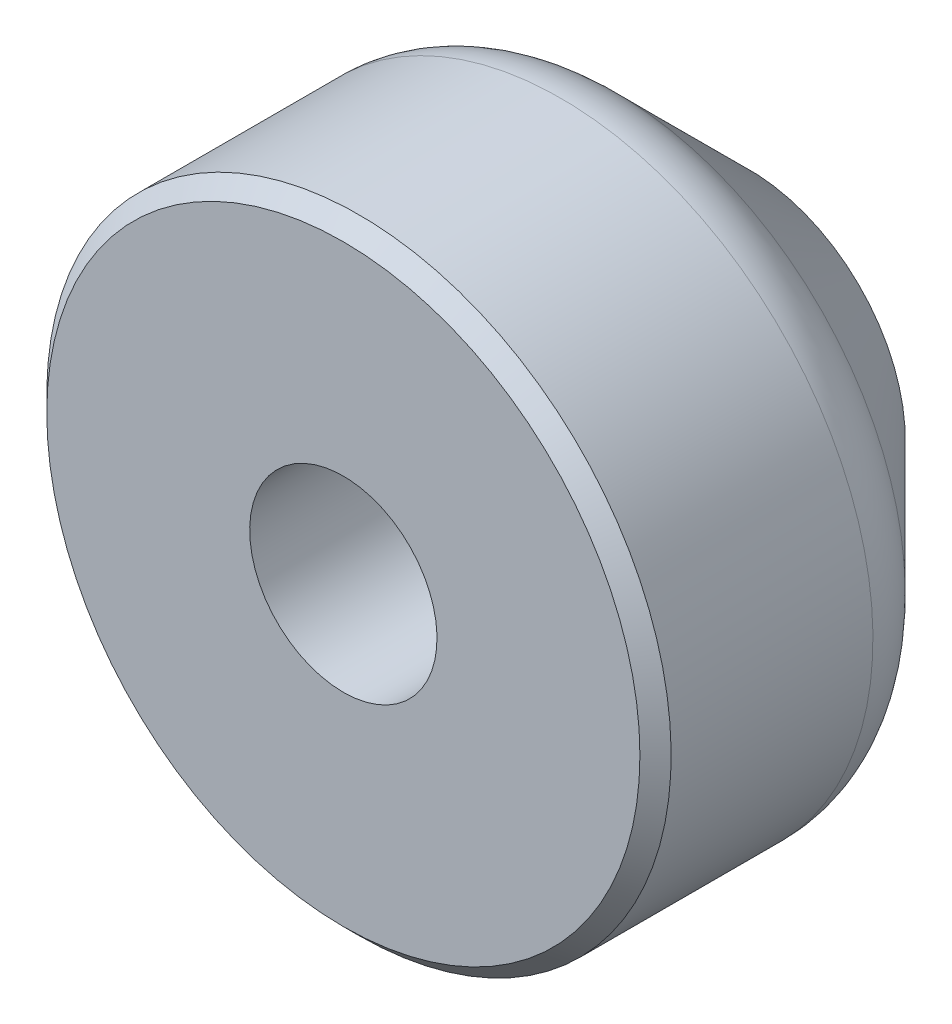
ISO-10303-21;
HEADER;
FILE_DESCRIPTION(('STEP AP214'),'2;1');
FILE_NAME('part.step','',(''),(''),'','','');
FILE_SCHEMA(('AUTOMOTIVE_DESIGN { 1 0 10303 214 1 1 1 1 }'));
ENDSEC;
DATA;
#1=APPLICATION_CONTEXT('core data for automotive mechanical design processes');
#2=APPLICATION_PROTOCOL_DEFINITION('international standard','automotive_design',2000,#1);
#3=PRODUCT_CONTEXT('',#1,'mechanical');
#4=PRODUCT('Part','Part','',(#3));
#5=PRODUCT_RELATED_PRODUCT_CATEGORY('part','',(#4));
#6=PRODUCT_DEFINITION_FORMATION('','',#4);
#7=PRODUCT_DEFINITION_CONTEXT('part definition',#1,'design');
#8=PRODUCT_DEFINITION('design','',#6,#7);
#9=PRODUCT_DEFINITION_SHAPE('','',#8);
#10=(LENGTH_UNIT() NAMED_UNIT(*) SI_UNIT(.MILLI.,.METRE.));
#11=(NAMED_UNIT(*) PLANE_ANGLE_UNIT() SI_UNIT($,.RADIAN.));
#12=(NAMED_UNIT(*) SI_UNIT($,.STERADIAN.) SOLID_ANGLE_UNIT());
#13=UNCERTAINTY_MEASURE_WITH_UNIT(LENGTH_MEASURE(1.E-05),#10,'distance_accuracy_value','');
#14=(GEOMETRIC_REPRESENTATION_CONTEXT(3) GLOBAL_UNCERTAINTY_ASSIGNED_CONTEXT((#13)) GLOBAL_UNIT_ASSIGNED_CONTEXT((#10,
#11,#12)) REPRESENTATION_CONTEXT('',''));
#15=CARTESIAN_POINT('',(0.,0.,0.));
#16=DIRECTION('',(0.,0.,1.));
#17=DIRECTION('',(1.,0.,0.));
#18=AXIS2_PLACEMENT_3D('',#15,#16,#17);
#19=CARTESIAN_POINT('',(0.,-6.,26.));
#20=DIRECTION('',(0.,0.,1.));
#21=DIRECTION('',(0.,-1.,0.));
#22=AXIS2_PLACEMENT_3D('',#19,#20,#21);
#23=PLANE('',#22);
#24=CARTESIAN_POINT('',(0.,0.,26.));
#25=DIRECTION('',(0.,0.,1.));
#26=DIRECTION('',(0.,-1.,0.));
#27=AXIS2_PLACEMENT_3D('',#24,#25,#26);
#28=CIRCLE('',#27,19.);
#29=CARTESIAN_POINT('',(0.,-19.,26.));
#30=VERTEX_POINT('',#29);
#31=EDGE_CURVE('E8',#30,#30,#28,.T.);
#32=ORIENTED_EDGE('',*,*,#31,.T.);
#33=EDGE_LOOP('',(#32));
#34=FACE_BOUND('',#33,.T.);
#35=CARTESIAN_POINT('',(0.,0.,26.));
#36=DIRECTION('',(0.,0.,1.));
#37=DIRECTION('',(0.,-1.,0.));
#38=AXIS2_PLACEMENT_3D('',#35,#36,#37);
#39=CIRCLE('',#38,6.);
#40=CARTESIAN_POINT('',(0.,-6.,26.));
#41=VERTEX_POINT('',#40);
#42=EDGE_CURVE('E37',#41,#41,#39,.T.);
#43=ORIENTED_EDGE('',*,*,#42,.F.);
#44=EDGE_LOOP('',(#43));
#45=FACE_BOUND('',#44,.T.);
#46=ADVANCED_FACE('F12',(#34,#45),#23,.T.);
#47=CARTESIAN_POINT('',(0.,0.,26.));
#48=DIRECTION('',(0.,0.,-1.));
#49=DIRECTION('',(0.,1.,0.));
#50=AXIS2_PLACEMENT_3D('',#47,#48,#49);
#51=CONICAL_SURFACE('',#50,19.,0.78539816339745);
#52=CARTESIAN_POINT('',(0.,0.,25.));
#53=DIRECTION('',(0.,0.,1.));
#54=DIRECTION('',(0.,-1.,0.));
#55=AXIS2_PLACEMENT_3D('',#52,#53,#54);
#56=CIRCLE('',#55,20.);
#57=CARTESIAN_POINT('',(0.,-20.,25.));
#58=VERTEX_POINT('',#57);
#59=EDGE_CURVE('E18',#58,#58,#56,.T.);
#60=ORIENTED_EDGE('',*,*,#59,.T.);
#61=EDGE_LOOP('',(#60));
#62=FACE_BOUND('',#61,.T.);
#63=ORIENTED_EDGE('',*,*,#31,.F.);
#64=EDGE_LOOP('',(#63));
#65=FACE_BOUND('',#64,.T.);
#66=ADVANCED_FACE('F44',(#62,#65),#51,.T.);
#67=CARTESIAN_POINT('',(0.,0.,35.92654879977));
#68=DIRECTION('',(0.,0.,1.));
#69=DIRECTION('',(0.,-1.,0.));
#70=AXIS2_PLACEMENT_3D('',#67,#68,#69);
#71=CYLINDRICAL_SURFACE('',#70,20.);
#72=CARTESIAN_POINT('',(0.,0.,12.0710678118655));
#73=DIRECTION('',(0.,0.,1.));
#74=DIRECTION('',(0.,-1.,0.));
#75=AXIS2_PLACEMENT_3D('',#72,#73,#74);
#76=CIRCLE('',#75,20.);
#77=CARTESIAN_POINT('',(0.,-20.,12.0710678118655));
#78=VERTEX_POINT('',#77);
#79=EDGE_CURVE('E22',#78,#78,#76,.T.);
#80=ORIENTED_EDGE('',*,*,#79,.T.);
#81=EDGE_LOOP('',(#80));
#82=FACE_BOUND('',#81,.T.);
#83=ORIENTED_EDGE('',*,*,#59,.F.);
#84=EDGE_LOOP('',(#83));
#85=FACE_BOUND('',#84,.T.);
#86=ADVANCED_FACE('F50',(#82,#85),#71,.T.);
#87=CARTESIAN_POINT('',(0.,0.,12.0710678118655));
#88=DIRECTION('',(0.,0.,1.));
#89=DIRECTION('',(0.,-1.,0.));
#90=AXIS2_PLACEMENT_3D('',#87,#88,#89);
#91=TOROIDAL_SURFACE('',#90,15.,5.);
#92=CARTESIAN_POINT('',(0.,0.,8.53553390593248));
#93=DIRECTION('',(0.,0.,1.));
#94=DIRECTION('',(0.,-1.,0.));
#95=AXIS2_PLACEMENT_3D('',#92,#93,#94);
#96=CIRCLE('',#95,18.5355339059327);
#97=CARTESIAN_POINT('',(0.,-18.5355339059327,8.53553390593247));
#98=VERTEX_POINT('',#97);
#99=EDGE_CURVE('E26',#98,#98,#96,.T.);
#100=ORIENTED_EDGE('',*,*,#99,.T.);
#101=EDGE_LOOP('',(#100));
#102=FACE_BOUND('',#101,.T.);
#103=ORIENTED_EDGE('',*,*,#79,.F.);
#104=EDGE_LOOP('',(#103));
#105=FACE_BOUND('',#104,.T.);
#106=ADVANCED_FACE('F55',(#102,#105),#91,.T.);
#107=CARTESIAN_POINT('',(0.,0.,8.53553390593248));
#108=DIRECTION('',(0.,0.,1.));
#109=DIRECTION('',(0.,-1.,0.));
#110=AXIS2_PLACEMENT_3D('',#107,#108,#109);
#111=CONICAL_SURFACE('',#110,18.5355339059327,0.785398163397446);
#112=CARTESIAN_POINT('',(0.,0.,0.));
#113=DIRECTION('',(0.,0.,1.));
#114=DIRECTION('',(0.,-1.,0.));
#115=AXIS2_PLACEMENT_3D('',#112,#113,#114);
#116=CIRCLE('',#115,10.);
#117=CARTESIAN_POINT('',(0.,-10.,0.));
#118=VERTEX_POINT('',#117);
#119=EDGE_CURVE('E31',#118,#118,#116,.T.);
#120=ORIENTED_EDGE('',*,*,#119,.T.);
#121=EDGE_LOOP('',(#120));
#122=FACE_BOUND('',#121,.T.);
#123=ORIENTED_EDGE('',*,*,#99,.F.);
#124=EDGE_LOOP('',(#123));
#125=FACE_BOUND('',#124,.T.);
#126=ADVANCED_FACE('F62',(#122,#125),#111,.T.);
#127=CARTESIAN_POINT('',(0.,-10.,0.));
#128=DIRECTION('',(0.,0.,-1.));
#129=DIRECTION('',(0.,1.,0.));
#130=AXIS2_PLACEMENT_3D('',#127,#128,#129);
#131=PLANE('',#130);
#132=CARTESIAN_POINT('',(0.,0.,0.));
#133=DIRECTION('',(0.,0.,1.));
#134=DIRECTION('',(0.,-1.,0.));
#135=AXIS2_PLACEMENT_3D('',#132,#133,#134);
#136=CIRCLE('',#135,6.);
#137=CARTESIAN_POINT('',(0.,-6.,0.));
#138=VERTEX_POINT('',#137);
#139=EDGE_CURVE('E34',#138,#138,#136,.T.);
#140=ORIENTED_EDGE('',*,*,#139,.T.);
#141=EDGE_LOOP('',(#140));
#142=FACE_BOUND('',#141,.T.);
#143=ORIENTED_EDGE('',*,*,#119,.F.);
#144=EDGE_LOOP('',(#143));
#145=FACE_BOUND('',#144,.T.);
#146=ADVANCED_FACE('F66',(#142,#145),#131,.T.);
#147=CARTESIAN_POINT('',(0.,0.,35.92654879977));
#148=DIRECTION('',(0.,0.,1.));
#149=DIRECTION('',(0.,-1.,0.));
#150=AXIS2_PLACEMENT_3D('',#147,#148,#149);
#151=CYLINDRICAL_SURFACE('',#150,6.);
#152=ORIENTED_EDGE('',*,*,#139,.F.);
#153=EDGE_LOOP('',(#152));
#154=FACE_BOUND('',#153,.T.);
#155=ORIENTED_EDGE('',*,*,#42,.T.);
#156=EDGE_LOOP('',(#155));
#157=FACE_BOUND('',#156,.T.);
#158=ADVANCED_FACE('F41',(#154,#157),#151,.F.);
#159=CLOSED_SHELL('',(#46,#66,#86,#106,#126,#146,#158));
#160=MANIFOLD_SOLID_BREP('B1',#159);
#161=ADVANCED_BREP_SHAPE_REPRESENTATION('',(#18,#160),#14);
#162=SHAPE_DEFINITION_REPRESENTATION(#9,#161);
ENDSEC;
END-ISO-10303-21;
